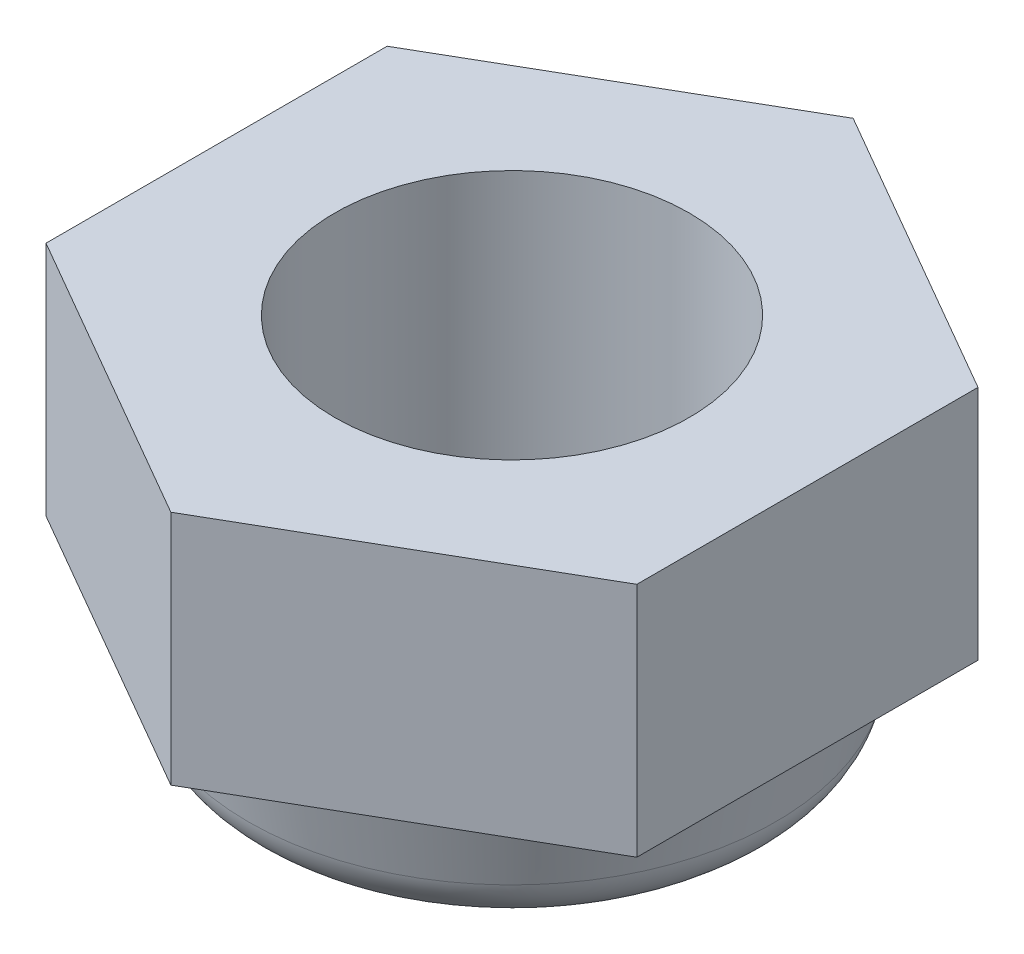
ISO-10303-21;
HEADER;
FILE_DESCRIPTION(('STEP AP214'),'2;1');
FILE_NAME('part.step','',(''),(''),'','','');
FILE_SCHEMA(('AUTOMOTIVE_DESIGN { 1 0 10303 214 1 1 1 1 }'));
ENDSEC;
DATA;
#1=APPLICATION_CONTEXT('core data for automotive mechanical design processes');
#2=APPLICATION_PROTOCOL_DEFINITION('international standard','automotive_design',2000,#1);
#3=PRODUCT_CONTEXT('',#1,'mechanical');
#4=PRODUCT('Part','Part','',(#3));
#5=PRODUCT_RELATED_PRODUCT_CATEGORY('part','',(#4));
#6=PRODUCT_DEFINITION_FORMATION('','',#4);
#7=PRODUCT_DEFINITION_CONTEXT('part definition',#1,'design');
#8=PRODUCT_DEFINITION('design','',#6,#7);
#9=PRODUCT_DEFINITION_SHAPE('','',#8);
#10=(LENGTH_UNIT() NAMED_UNIT(*) SI_UNIT(.MILLI.,.METRE.));
#11=(NAMED_UNIT(*) PLANE_ANGLE_UNIT() SI_UNIT($,.RADIAN.));
#12=(NAMED_UNIT(*) SI_UNIT($,.STERADIAN.) SOLID_ANGLE_UNIT());
#13=UNCERTAINTY_MEASURE_WITH_UNIT(LENGTH_MEASURE(1.E-05),#10,'distance_accuracy_value','');
#14=(GEOMETRIC_REPRESENTATION_CONTEXT(3) GLOBAL_UNCERTAINTY_ASSIGNED_CONTEXT((#13)) GLOBAL_UNIT_ASSIGNED_CONTEXT((#10,
#11,#12)) REPRESENTATION_CONTEXT('',''));
#15=CARTESIAN_POINT('',(0.,0.,0.));
#16=DIRECTION('',(0.,0.,1.));
#17=DIRECTION('',(1.,0.,0.));
#18=AXIS2_PLACEMENT_3D('',#15,#16,#17);
#19=CARTESIAN_POINT('',(0.,-0.160776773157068,0.));
#20=DIRECTION('',(0.,1.,0.));
#21=DIRECTION('',(0.,0.,1.));
#22=AXIS2_PLACEMENT_3D('',#19,#20,#21);
#23=CONICAL_SURFACE('',#22,4.66784464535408,0.197395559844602);
#24=CARTESIAN_POINT('',(0.,-0.160776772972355,0.));
#25=DIRECTION('',(0.,1.,0.));
#26=DIRECTION('',(0.,0.,1.));
#27=AXIS2_PLACEMENT_3D('',#24,#25,#26);
#28=CIRCLE('',#27,4.66784464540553);
#29=CARTESIAN_POINT('',(0.,-0.160776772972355,4.66784464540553));
#30=VERTEX_POINT('',#29);
#31=EDGE_CURVE('E93',#30,#30,#28,.F.);
#32=ORIENTED_EDGE('',*,*,#31,.T.);
#33=EDGE_LOOP('',(#32));
#34=FACE_BOUND('',#33,.T.);
#35=CARTESIAN_POINT('',(0.,-1.19611613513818,0.));
#36=DIRECTION('',(0.,-1.,0.));
#37=DIRECTION('',(0.,0.,-1.));
#38=AXIS2_PLACEMENT_3D('',#35,#36,#37);
#39=CIRCLE('',#38,4.46077677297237);
#40=CARTESIAN_POINT('',(0.,-1.19611613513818,-4.46077677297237));
#41=VERTEX_POINT('',#40);
#42=EDGE_CURVE('E155',#41,#41,#39,.T.);
#43=ORIENTED_EDGE('',*,*,#42,.F.);
#44=EDGE_LOOP('',(#43));
#45=FACE_BOUND('',#44,.T.);
#46=ADVANCED_FACE('F17',(#34,#45),#23,.T.);
#47=CARTESIAN_POINT('',(0.,-1.,0.));
#48=DIRECTION('',(0.,-1.,0.));
#49=DIRECTION('',(0.,0.,-1.));
#50=AXIS2_PLACEMENT_3D('',#47,#48,#49);
#51=TOROIDAL_SURFACE('',#50,3.48019609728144,1.);
#52=ORIENTED_EDGE('',*,*,#42,.T.);
#53=EDGE_LOOP('',(#52));
#54=FACE_BOUND('',#53,.T.);
#55=CARTESIAN_POINT('',(0.,-2.,0.));
#56=DIRECTION('',(0.,1.,0.));
#57=DIRECTION('',(0.,0.,-1.));
#58=AXIS2_PLACEMENT_3D('',#55,#56,#57);
#59=CIRCLE('',#58,3.48019609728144);
#60=CARTESIAN_POINT('',(0.,-2.,3.48019609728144));
#61=VERTEX_POINT('',#60);
#62=CARTESIAN_POINT('',(0.,-2.,-3.48019609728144));
#63=VERTEX_POINT('',#62);
#64=EDGE_CURVE('E82',#61,#63,#59,.F.);
#65=ORIENTED_EDGE('',*,*,#64,.F.);
#66=CARTESIAN_POINT('',(0.,-2.,0.));
#67=DIRECTION('',(0.,1.,0.));
#68=DIRECTION('',(0.,0.,1.));
#69=AXIS2_PLACEMENT_3D('',#66,#67,#68);
#70=CIRCLE('',#69,3.48019609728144);
#71=EDGE_CURVE('E80',#63,#61,#70,.F.);
#72=ORIENTED_EDGE('',*,*,#71,.F.);
#73=EDGE_LOOP('',(#65,#72));
#74=FACE_BOUND('',#73,.T.);
#75=ADVANCED_FACE('F84',(#54,#74),#51,.T.);
#76=CARTESIAN_POINT('',(0.,-0.200000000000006,0.));
#77=DIRECTION('',(0.,1.,0.));
#78=DIRECTION('',(0.,0.,1.));
#79=AXIS2_PLACEMENT_3D('',#76,#77,#78);
#80=TOROIDAL_SURFACE('',#79,4.86396078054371,0.2);
#81=CARTESIAN_POINT('',(0.,0.,0.));
#82=DIRECTION('',(0.,-1.,0.));
#83=DIRECTION('',(0.,0.,-1.));
#84=AXIS2_PLACEMENT_3D('',#81,#82,#83);
#85=CIRCLE('',#84,4.86396078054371);
#86=CARTESIAN_POINT('',(0.,0.,-4.86396078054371));
#87=VERTEX_POINT('',#86);
#88=CARTESIAN_POINT('',(0.,0.,4.86396078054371));
#89=VERTEX_POINT('',#88);
#90=EDGE_CURVE('E131',#87,#89,#85,.T.);
#91=ORIENTED_EDGE('',*,*,#90,.T.);
#92=CARTESIAN_POINT('',(0.,0.,0.));
#93=DIRECTION('',(0.,-1.,0.));
#94=DIRECTION('',(0.,0.,1.));
#95=AXIS2_PLACEMENT_3D('',#92,#93,#94);
#96=CIRCLE('',#95,4.86396078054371);
#97=EDGE_CURVE('E87',#89,#87,#96,.T.);
#98=ORIENTED_EDGE('',*,*,#97,.T.);
#99=EDGE_LOOP('',(#91,#98));
#100=FACE_BOUND('',#99,.T.);
#101=ORIENTED_EDGE('',*,*,#31,.F.);
#102=EDGE_LOOP('',(#101));
#103=FACE_BOUND('',#102,.T.);
#104=ADVANCED_FACE('F113',(#100,#103),#80,.F.);
#105=CARTESIAN_POINT('',(4.30000000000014,-2.,0.));
#106=DIRECTION('',(0.,-1.,0.));
#107=DIRECTION('',(1.,0.,0.));
#108=AXIS2_PLACEMENT_3D('',#105,#106,#107);
#109=PLANE('',#108);
#110=ORIENTED_EDGE('',*,*,#71,.T.);
#111=ORIENTED_EDGE('',*,*,#64,.T.);
#112=EDGE_LOOP('',(#110,#111));
#113=FACE_BOUND('',#112,.T.);
#114=CARTESIAN_POINT('',(0.,-2.,0.));
#115=DIRECTION('',(0.,1.,0.));
#116=DIRECTION('',(0.,0.,1.));
#117=AXIS2_PLACEMENT_3D('',#114,#115,#116);
#118=CIRCLE('',#117,3.);
#119=CARTESIAN_POINT('',(0.,-2.,3.));
#120=VERTEX_POINT('',#119);
#121=EDGE_CURVE('E163',#120,#120,#118,.T.);
#122=ORIENTED_EDGE('',*,*,#121,.T.);
#123=EDGE_LOOP('',(#122));
#124=FACE_BOUND('',#123,.T.);
#125=ADVANCED_FACE('F91',(#113,#124),#109,.T.);
#126=CARTESIAN_POINT('',(0.,0.,-5.77350269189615));
#127=DIRECTION('',(0.,1.,0.));
#128=DIRECTION('',(-1.,0.,0.));
#129=AXIS2_PLACEMENT_3D('',#126,#127,#128);
#130=PLANE('',#129);
#131=DIRECTION('',(0.,0.,1.));
#132=VECTOR('',#131,1.);
#133=CARTESIAN_POINT('',(5.00000000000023,0.,2.88675134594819));
#134=LINE('',#133,#132);
#135=CARTESIAN_POINT('',(5.00000000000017,0.,-2.88675134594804));
#136=VERTEX_POINT('',#135);
#137=CARTESIAN_POINT('',(5.00000000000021,0.,2.88675134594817));
#138=VERTEX_POINT('',#137);
#139=EDGE_CURVE('E162',#136,#138,#134,.T.);
#140=ORIENTED_EDGE('',*,*,#139,.T.);
#141=DIRECTION('',(-0.866025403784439,0.,0.5));
#142=VECTOR('',#141,1.);
#143=CARTESIAN_POINT('',(1.1102230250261E-13,0.,5.77350269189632));
#144=LINE('',#143,#142);
#145=CARTESIAN_POINT('',(1.1015494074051E-13,0.,5.77350269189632));
#146=VERTEX_POINT('',#145);
#147=EDGE_CURVE('E205',#138,#146,#144,.T.);
#148=ORIENTED_EDGE('',*,*,#147,.T.);
#149=DIRECTION('',(-0.866025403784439,0.,-0.5));
#150=VECTOR('',#149,1.);
#151=CARTESIAN_POINT('',(-4.99999999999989,0.,2.88675134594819));
#152=LINE('',#151,#150);
#153=CARTESIAN_POINT('',(-4.99999999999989,0.,2.88675134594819));
#154=VERTEX_POINT('',#153);
#155=EDGE_CURVE('E200',#146,#154,#152,.T.);
#156=ORIENTED_EDGE('',*,*,#155,.T.);
#157=DIRECTION('',(0.,0.,-1.));
#158=VECTOR('',#157,1.);
#159=CARTESIAN_POINT('',(-4.99999999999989,0.,-2.88675134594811));
#160=LINE('',#159,#158);
#161=CARTESIAN_POINT('',(-4.99999999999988,0.,-2.88675134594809));
#162=VERTEX_POINT('',#161);
#163=EDGE_CURVE('E195',#154,#162,#160,.T.);
#164=ORIENTED_EDGE('',*,*,#163,.T.);
#165=DIRECTION('',(0.866025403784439,0.,-0.5));
#166=VECTOR('',#165,1.);
#167=CARTESIAN_POINT('',(0.,0.,-5.77350269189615));
#168=LINE('',#167,#166);
#169=CARTESIAN_POINT('',(0.,0.,-5.77350269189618));
#170=VERTEX_POINT('',#169);
#171=EDGE_CURVE('E190',#162,#170,#168,.T.);
#172=ORIENTED_EDGE('',*,*,#171,.T.);
#173=DIRECTION('',(0.866025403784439,0.,0.5));
#174=VECTOR('',#173,1.);
#175=CARTESIAN_POINT('',(5.00000000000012,0.,-2.88675134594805));
#176=LINE('',#175,#174);
#177=EDGE_CURVE('E166',#170,#136,#176,.T.);
#178=ORIENTED_EDGE('',*,*,#177,.T.);
#179=EDGE_LOOP('',(#140,#148,#156,#164,#172,#178));
#180=FACE_BOUND('',#179,.T.);
#181=ORIENTED_EDGE('',*,*,#97,.F.);
#182=ORIENTED_EDGE('',*,*,#90,.F.);
#183=EDGE_LOOP('',(#181,#182));
#184=FACE_BOUND('',#183,.T.);
#185=ADVANCED_FACE('F112',(#180,#184),#130,.F.);
#186=CARTESIAN_POINT('',(0.,-2.,0.));
#187=DIRECTION('',(0.,1.,0.));
#188=DIRECTION('',(0.,0.,1.));
#189=AXIS2_PLACEMENT_3D('',#186,#187,#188);
#190=CYLINDRICAL_SURFACE('',#189,3.);
#191=CARTESIAN_POINT('',(0.,4.,0.));
#192=DIRECTION('',(0.,1.,0.));
#193=DIRECTION('',(0.,0.,1.));
#194=AXIS2_PLACEMENT_3D('',#191,#192,#193);
#195=CIRCLE('',#194,3.);
#196=CARTESIAN_POINT('',(0.,4.,3.));
#197=VERTEX_POINT('',#196);
#198=EDGE_CURVE('E158',#197,#197,#195,.F.);
#199=ORIENTED_EDGE('',*,*,#198,.F.);
#200=EDGE_LOOP('',(#199));
#201=FACE_BOUND('',#200,.T.);
#202=ORIENTED_EDGE('',*,*,#121,.F.);
#203=EDGE_LOOP('',(#202));
#204=FACE_BOUND('',#203,.T.);
#205=ADVANCED_FACE('F311',(#201,#204),#190,.F.);
#206=CARTESIAN_POINT('',(5.00000000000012,4.,-2.88675134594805));
#207=DIRECTION('',(-0.5,0.,0.866025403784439));
#208=DIRECTION('',(0.866025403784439,0.,0.5));
#209=AXIS2_PLACEMENT_3D('',#206,#207,#208);
#210=PLANE('',#209);
#211=DIRECTION('',(0.,1.,0.));
#212=VECTOR('',#211,1.);
#213=CARTESIAN_POINT('',(0.,4.,-5.77350269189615));
#214=LINE('',#213,#212);
#215=CARTESIAN_POINT('',(0.,4.,-5.77350269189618));
#216=VERTEX_POINT('',#215);
#217=EDGE_CURVE('E188',#170,#216,#214,.T.);
#218=ORIENTED_EDGE('',*,*,#217,.T.);
#219=DIRECTION('',(-0.866025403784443,0.,-0.499999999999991));
#220=VECTOR('',#219,1.);
#221=CARTESIAN_POINT('',(5.00000000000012,4.,-2.88675134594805));
#222=LINE('',#221,#220);
#223=CARTESIAN_POINT('',(5.00000000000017,4.,-2.88675134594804));
#224=VERTEX_POINT('',#223);
#225=EDGE_CURVE('E161',#224,#216,#222,.T.);
#226=ORIENTED_EDGE('',*,*,#225,.F.);
#227=DIRECTION('',(0.,1.,0.));
#228=VECTOR('',#227,1.);
#229=CARTESIAN_POINT('',(5.00000000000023,4.,-2.88675134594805));
#230=LINE('',#229,#228);
#231=EDGE_CURVE('E209',#224,#136,#230,.F.);
#232=ORIENTED_EDGE('',*,*,#231,.T.);
#233=ORIENTED_EDGE('',*,*,#177,.F.);
#234=EDGE_LOOP('',(#218,#226,#232,#233));
#235=FACE_BOUND('',#234,.T.);
#236=ADVANCED_FACE('F241',(#235),#210,.F.);
#237=CARTESIAN_POINT('',(0.,4.,-5.77350269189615));
#238=DIRECTION('',(0.5,0.,0.866025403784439));
#239=DIRECTION('',(0.866025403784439,0.,-0.5));
#240=AXIS2_PLACEMENT_3D('',#237,#238,#239);
#241=PLANE('',#240);
#242=DIRECTION('',(0.,1.,0.));
#243=VECTOR('',#242,1.);
#244=CARTESIAN_POINT('',(-4.99999999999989,4.,-2.88675134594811));
#245=LINE('',#244,#243);
#246=CARTESIAN_POINT('',(-4.99999999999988,4.,-2.88675134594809));
#247=VERTEX_POINT('',#246);
#248=EDGE_CURVE('E193',#162,#247,#245,.T.);
#249=ORIENTED_EDGE('',*,*,#248,.T.);
#250=DIRECTION('',(-0.866025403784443,0.,0.499999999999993));
#251=VECTOR('',#250,1.);
#252=CARTESIAN_POINT('',(0.,4.,-5.77350269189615));
#253=LINE('',#252,#251);
#254=EDGE_CURVE('E216',#216,#247,#253,.T.);
#255=ORIENTED_EDGE('',*,*,#254,.F.);
#256=ORIENTED_EDGE('',*,*,#217,.F.);
#257=ORIENTED_EDGE('',*,*,#171,.F.);
#258=EDGE_LOOP('',(#249,#255,#256,#257));
#259=FACE_BOUND('',#258,.T.);
#260=ADVANCED_FACE('F246',(#259),#241,.F.);
#261=CARTESIAN_POINT('',(-4.99999999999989,4.,-2.88675134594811));
#262=DIRECTION('',(1.,0.,0.));
#263=DIRECTION('',(0.,0.,-1.));
#264=AXIS2_PLACEMENT_3D('',#261,#262,#263);
#265=PLANE('',#264);
#266=DIRECTION('',(0.,1.,0.));
#267=VECTOR('',#266,1.);
#268=CARTESIAN_POINT('',(-4.99999999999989,4.,2.88675134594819));
#269=LINE('',#268,#267);
#270=CARTESIAN_POINT('',(-4.99999999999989,4.,2.88675134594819));
#271=VERTEX_POINT('',#270);
#272=EDGE_CURVE('E198',#154,#271,#269,.T.);
#273=ORIENTED_EDGE('',*,*,#272,.T.);
#274=DIRECTION('',(0.,0.,1.));
#275=VECTOR('',#274,1.);
#276=CARTESIAN_POINT('',(-4.99999999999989,4.,-5.77350269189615));
#277=LINE('',#276,#275);
#278=EDGE_CURVE('E219',#247,#271,#277,.T.);
#279=ORIENTED_EDGE('',*,*,#278,.F.);
#280=ORIENTED_EDGE('',*,*,#248,.F.);
#281=ORIENTED_EDGE('',*,*,#163,.F.);
#282=EDGE_LOOP('',(#273,#279,#280,#281));
#283=FACE_BOUND('',#282,.T.);
#284=ADVANCED_FACE('F249',(#283),#265,.F.);
#285=CARTESIAN_POINT('',(-4.99999999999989,4.,2.88675134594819));
#286=DIRECTION('',(0.5,0.,-0.866025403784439));
#287=DIRECTION('',(-0.866025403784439,0.,-0.5));
#288=AXIS2_PLACEMENT_3D('',#285,#286,#287);
#289=PLANE('',#288);
#290=DIRECTION('',(0.,1.,0.));
#291=VECTOR('',#290,1.);
#292=CARTESIAN_POINT('',(1.11022302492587E-13,4.,5.77350269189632));
#293=LINE('',#292,#291);
#294=CARTESIAN_POINT('',(1.10154940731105E-13,4.,5.77350269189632));
#295=VERTEX_POINT('',#294);
#296=EDGE_CURVE('E203',#146,#295,#293,.T.);
#297=ORIENTED_EDGE('',*,*,#296,.T.);
#298=DIRECTION('',(0.866025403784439,0.,0.499999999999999));
#299=VECTOR('',#298,1.);
#300=CARTESIAN_POINT('',(-4.99999999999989,4.,2.88675134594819));
#301=LINE('',#300,#299);
#302=EDGE_CURVE('E222',#271,#295,#301,.T.);
#303=ORIENTED_EDGE('',*,*,#302,.F.);
#304=ORIENTED_EDGE('',*,*,#272,.F.);
#305=ORIENTED_EDGE('',*,*,#155,.F.);
#306=EDGE_LOOP('',(#297,#303,#304,#305));
#307=FACE_BOUND('',#306,.T.);
#308=ADVANCED_FACE('F233',(#307),#289,.F.);
#309=CARTESIAN_POINT('',(1.11022302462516E-13,4.,5.77350269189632));
#310=DIRECTION('',(-0.5,0.,-0.866025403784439));
#311=DIRECTION('',(-0.866025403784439,0.,0.5));
#312=AXIS2_PLACEMENT_3D('',#309,#310,#311);
#313=PLANE('',#312);
#314=DIRECTION('',(0.,1.,0.));
#315=VECTOR('',#314,1.);
#316=CARTESIAN_POINT('',(5.00000000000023,4.,2.88675134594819));
#317=LINE('',#316,#315);
#318=CARTESIAN_POINT('',(5.00000000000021,4.,2.88675134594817));
#319=VERTEX_POINT('',#318);
#320=EDGE_CURVE('E36',#138,#319,#317,.T.);
#321=ORIENTED_EDGE('',*,*,#320,.T.);
#322=DIRECTION('',(0.866025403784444,0.,-0.499999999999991));
#323=VECTOR('',#322,1.);
#324=CARTESIAN_POINT('',(1.11022302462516E-13,4.,5.77350269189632));
#325=LINE('',#324,#323);
#326=EDGE_CURVE('E27',#295,#319,#325,.T.);
#327=ORIENTED_EDGE('',*,*,#326,.F.);
#328=ORIENTED_EDGE('',*,*,#296,.F.);
#329=ORIENTED_EDGE('',*,*,#147,.F.);
#330=EDGE_LOOP('',(#321,#327,#328,#329));
#331=FACE_BOUND('',#330,.T.);
#332=ADVANCED_FACE('F231',(#331),#313,.F.);
#333=CARTESIAN_POINT('',(5.00000000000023,4.,2.88675134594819));
#334=DIRECTION('',(-1.,0.,0.));
#335=DIRECTION('',(0.,0.,1.));
#336=AXIS2_PLACEMENT_3D('',#333,#334,#335);
#337=PLANE('',#336);
#338=ORIENTED_EDGE('',*,*,#231,.F.);
#339=DIRECTION('',(0.,0.,1.));
#340=VECTOR('',#339,1.);
#341=CARTESIAN_POINT('',(5.00000000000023,4.,-5.77350269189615));
#342=LINE('',#341,#340);
#343=EDGE_CURVE('E11',#319,#224,#342,.F.);
#344=ORIENTED_EDGE('',*,*,#343,.F.);
#345=ORIENTED_EDGE('',*,*,#320,.F.);
#346=ORIENTED_EDGE('',*,*,#139,.F.);
#347=EDGE_LOOP('',(#338,#344,#345,#346));
#348=FACE_BOUND('',#347,.T.);
#349=ADVANCED_FACE('F239',(#348),#337,.F.);
#350=CARTESIAN_POINT('',(0.,4.,-5.77350269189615));
#351=DIRECTION('',(0.,1.,0.));
#352=DIRECTION('',(-1.,0.,0.));
#353=AXIS2_PLACEMENT_3D('',#350,#351,#352);
#354=PLANE('',#353);
#355=ORIENTED_EDGE('',*,*,#326,.T.);
#356=ORIENTED_EDGE('',*,*,#343,.T.);
#357=ORIENTED_EDGE('',*,*,#225,.T.);
#358=ORIENTED_EDGE('',*,*,#254,.T.);
#359=ORIENTED_EDGE('',*,*,#278,.T.);
#360=ORIENTED_EDGE('',*,*,#302,.T.);
#361=EDGE_LOOP('',(#355,#356,#357,#358,#359,#360));
#362=FACE_BOUND('',#361,.T.);
#363=ORIENTED_EDGE('',*,*,#198,.T.);
#364=EDGE_LOOP('',(#363));
#365=FACE_BOUND('',#364,.T.);
#366=ADVANCED_FACE('F227',(#362,#365),#354,.T.);
#367=CLOSED_SHELL('',(#46,#75,#104,#125,#185,#205,#236,#260,#284,#308,#332,#349,#366));
#368=MANIFOLD_SOLID_BREP('B1',#367);
#369=ADVANCED_BREP_SHAPE_REPRESENTATION('',(#18,#368),#14);
#370=SHAPE_DEFINITION_REPRESENTATION(#9,#369);
ENDSEC;
END-ISO-10303-21;
